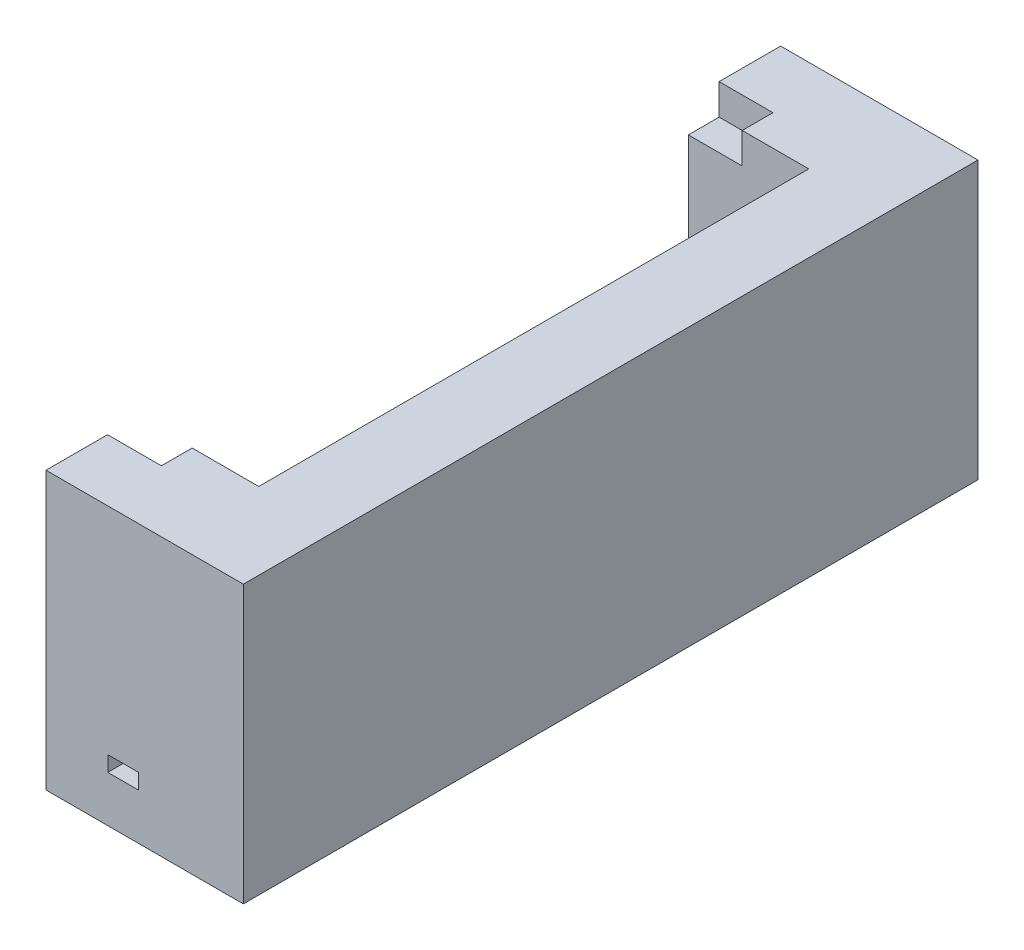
ISO-10303-21;
HEADER;
FILE_DESCRIPTION(('STEP AP214'),'2;1');
FILE_NAME('part.step','',(''),(''),'','','');
FILE_SCHEMA(('AUTOMOTIVE_DESIGN { 1 0 10303 214 1 1 1 1 }'));
ENDSEC;
DATA;
#1=APPLICATION_CONTEXT('core data for automotive mechanical design processes');
#2=APPLICATION_PROTOCOL_DEFINITION('international standard','automotive_design',2000,#1);
#3=PRODUCT_CONTEXT('',#1,'mechanical');
#4=PRODUCT('Part','Part','',(#3));
#5=PRODUCT_RELATED_PRODUCT_CATEGORY('part','',(#4));
#6=PRODUCT_DEFINITION_FORMATION('','',#4);
#7=PRODUCT_DEFINITION_CONTEXT('part definition',#1,'design');
#8=PRODUCT_DEFINITION('design','',#6,#7);
#9=PRODUCT_DEFINITION_SHAPE('','',#8);
#10=(LENGTH_UNIT() NAMED_UNIT(*) SI_UNIT(.MILLI.,.METRE.));
#11=(NAMED_UNIT(*) PLANE_ANGLE_UNIT() SI_UNIT($,.RADIAN.));
#12=(NAMED_UNIT(*) SI_UNIT($,.STERADIAN.) SOLID_ANGLE_UNIT());
#13=UNCERTAINTY_MEASURE_WITH_UNIT(LENGTH_MEASURE(1.E-05),#10,'distance_accuracy_value','');
#14=(GEOMETRIC_REPRESENTATION_CONTEXT(3) GLOBAL_UNCERTAINTY_ASSIGNED_CONTEXT((#13)) GLOBAL_UNIT_ASSIGNED_CONTEXT((#10,
#11,#12)) REPRESENTATION_CONTEXT('',''));
#15=CARTESIAN_POINT('',(0.,0.,0.));
#16=DIRECTION('',(0.,0.,1.));
#17=DIRECTION('',(1.,0.,0.));
#18=AXIS2_PLACEMENT_3D('',#15,#16,#17);
#19=CARTESIAN_POINT('',(0.,0.,71.6587736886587));
#20=DIRECTION('',(0.,0.,-1.));
#21=DIRECTION('',(-1.,0.,0.));
#22=AXIS2_PLACEMENT_3D('',#19,#20,#21);
#23=PLANE('',#22);
#24=DIRECTION('',(0.,1.,0.));
#25=VECTOR('',#24,1.);
#26=CARTESIAN_POINT('',(49.5032063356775,42.3385551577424,71.6587736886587));
#27=LINE('',#26,#25);
#28=CARTESIAN_POINT('',(49.5032063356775,6.33855515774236,71.6587736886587));
#29=VERTEX_POINT('',#28);
#30=CARTESIAN_POINT('',(49.5032063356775,42.3385551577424,71.6587736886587));
#31=VERTEX_POINT('',#30);
#32=EDGE_CURVE('E382',#29,#31,#27,.T.);
#33=ORIENTED_EDGE('',*,*,#32,.T.);
#34=DIRECTION('',(-1.,0.,0.));
#35=VECTOR('',#34,1.);
#36=CARTESIAN_POINT('',(49.5032063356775,42.3385551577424,71.6587736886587));
#37=LINE('',#36,#35);
#38=CARTESIAN_POINT('',(23.8495376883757,42.3385551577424,71.6587736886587));
#39=VERTEX_POINT('',#38);
#40=EDGE_CURVE('E385',#31,#39,#37,.T.);
#41=ORIENTED_EDGE('',*,*,#40,.T.);
#42=DIRECTION('',(0.,-1.,0.));
#43=VECTOR('',#42,1.);
#44=CARTESIAN_POINT('',(23.8495376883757,42.3385551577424,71.6587736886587));
#45=LINE('',#44,#43);
#46=CARTESIAN_POINT('',(23.8495376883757,6.33855515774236,71.6587736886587));
#47=VERTEX_POINT('',#46);
#48=EDGE_CURVE('E388',#39,#47,#45,.T.);
#49=ORIENTED_EDGE('',*,*,#48,.T.);
#50=DIRECTION('',(1.,0.,0.));
#51=VECTOR('',#50,1.);
#52=CARTESIAN_POINT('',(49.5032063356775,6.33855515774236,71.6587736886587));
#53=LINE('',#52,#51);
#54=EDGE_CURVE('E391',#47,#29,#53,.T.);
#55=ORIENTED_EDGE('',*,*,#54,.T.);
#56=EDGE_LOOP('',(#33,#41,#49,#55));
#57=FACE_BOUND('',#56,.T.);
#58=DIRECTION('',(0.,-1.,0.));
#59=VECTOR('',#58,1.);
#60=CARTESIAN_POINT('',(31.8797435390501,12.3385551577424,71.6587736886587));
#61=LINE('',#60,#59);
#62=CARTESIAN_POINT('',(31.8797435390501,14.3385551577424,71.6587736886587));
#63=VERTEX_POINT('',#62);
#64=CARTESIAN_POINT('',(31.8797435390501,12.3385551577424,71.6587736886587));
#65=VERTEX_POINT('',#64);
#66=EDGE_CURVE('E348',#63,#65,#61,.T.);
#67=ORIENTED_EDGE('',*,*,#66,.F.);
#68=DIRECTION('',(-1.,0.,0.));
#69=VECTOR('',#68,1.);
#70=CARTESIAN_POINT('',(31.8797435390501,14.3385551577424,71.6587736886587));
#71=LINE('',#70,#69);
#72=CARTESIAN_POINT('',(35.8797435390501,14.3385551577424,71.6587736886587));
#73=VERTEX_POINT('',#72);
#74=EDGE_CURVE('E356',#73,#63,#71,.T.);
#75=ORIENTED_EDGE('',*,*,#74,.F.);
#76=DIRECTION('',(0.,1.,0.));
#77=VECTOR('',#76,1.);
#78=CARTESIAN_POINT('',(35.8797435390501,12.3385551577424,71.6587736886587));
#79=LINE('',#78,#77);
#80=CARTESIAN_POINT('',(35.8797435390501,12.3385551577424,71.6587736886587));
#81=VERTEX_POINT('',#80);
#82=EDGE_CURVE('E354',#81,#73,#79,.T.);
#83=ORIENTED_EDGE('',*,*,#82,.F.);
#84=DIRECTION('',(1.,0.,0.));
#85=VECTOR('',#84,1.);
#86=CARTESIAN_POINT('',(31.8797435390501,12.3385551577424,71.6587736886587));
#87=LINE('',#86,#85);
#88=EDGE_CURVE('E337',#65,#81,#87,.T.);
#89=ORIENTED_EDGE('',*,*,#88,.F.);
#90=EDGE_LOOP('',(#67,#75,#83,#89));
#91=FACE_BOUND('',#90,.T.);
#92=ADVANCED_FACE('F123',(#57,#91),#23,.F.);
#93=CARTESIAN_POINT('',(0.,0.,-23.8412263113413));
#94=DIRECTION('',(0.,0.,-1.));
#95=DIRECTION('',(-1.,0.,0.));
#96=AXIS2_PLACEMENT_3D('',#93,#94,#95);
#97=PLANE('',#96);
#98=DIRECTION('',(0.,-1.,0.));
#99=VECTOR('',#98,1.);
#100=CARTESIAN_POINT('',(49.5032063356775,42.3385551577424,-23.8412263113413));
#101=LINE('',#100,#99);
#102=CARTESIAN_POINT('',(49.5032063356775,42.3385551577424,-23.8412263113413));
#103=VERTEX_POINT('',#102);
#104=CARTESIAN_POINT('',(49.5032063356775,6.33855515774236,-23.8412263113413));
#105=VERTEX_POINT('',#104);
#106=EDGE_CURVE('E370',#103,#105,#101,.T.);
#107=ORIENTED_EDGE('',*,*,#106,.T.);
#108=DIRECTION('',(-1.,0.,0.));
#109=VECTOR('',#108,1.);
#110=CARTESIAN_POINT('',(49.5032063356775,6.33855515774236,-23.8412263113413));
#111=LINE('',#110,#109);
#112=CARTESIAN_POINT('',(23.8495376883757,6.33855515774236,-23.8412263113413));
#113=VERTEX_POINT('',#112);
#114=EDGE_CURVE('E373',#105,#113,#111,.T.);
#115=ORIENTED_EDGE('',*,*,#114,.T.);
#116=DIRECTION('',(0.,1.,0.));
#117=VECTOR('',#116,1.);
#118=CARTESIAN_POINT('',(23.8495376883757,42.3385551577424,-23.8412263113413));
#119=LINE('',#118,#117);
#120=CARTESIAN_POINT('',(23.8495376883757,42.3385551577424,-23.8412263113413));
#121=VERTEX_POINT('',#120);
#122=EDGE_CURVE('E376',#113,#121,#119,.T.);
#123=ORIENTED_EDGE('',*,*,#122,.T.);
#124=DIRECTION('',(1.,0.,0.));
#125=VECTOR('',#124,1.);
#126=CARTESIAN_POINT('',(49.5032063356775,42.3385551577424,-23.8412263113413));
#127=LINE('',#126,#125);
#128=EDGE_CURVE('E379',#121,#103,#127,.T.);
#129=ORIENTED_EDGE('',*,*,#128,.T.);
#130=EDGE_LOOP('',(#107,#115,#123,#129));
#131=FACE_BOUND('',#130,.T.);
#132=DIRECTION('',(-1.,0.,0.));
#133=VECTOR('',#132,1.);
#134=CARTESIAN_POINT('',(39.494659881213,12.3385551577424,-23.8412263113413));
#135=LINE('',#134,#133);
#136=CARTESIAN_POINT('',(39.494659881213,12.3385551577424,-23.8412263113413));
#137=VERTEX_POINT('',#136);
#138=CARTESIAN_POINT('',(35.494659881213,12.3385551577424,-23.8412263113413));
#139=VERTEX_POINT('',#138);
#140=EDGE_CURVE('E363',#137,#139,#135,.T.);
#141=ORIENTED_EDGE('',*,*,#140,.F.);
#142=DIRECTION('',(0.,-1.,0.));
#143=VECTOR('',#142,1.);
#144=CARTESIAN_POINT('',(39.494659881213,12.3385551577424,-23.8412263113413));
#145=LINE('',#144,#143);
#146=CARTESIAN_POINT('',(39.494659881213,14.2885551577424,-23.8412263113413));
#147=VERTEX_POINT('',#146);
#148=EDGE_CURVE('E360',#147,#137,#145,.T.);
#149=ORIENTED_EDGE('',*,*,#148,.F.);
#150=DIRECTION('',(1.,0.,0.));
#151=VECTOR('',#150,1.);
#152=CARTESIAN_POINT('',(39.494659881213,14.2885551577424,-23.8412263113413));
#153=LINE('',#152,#151);
#154=CARTESIAN_POINT('',(35.494659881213,14.2885551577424,-23.8412263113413));
#155=VERTEX_POINT('',#154);
#156=EDGE_CURVE('E368',#155,#147,#153,.T.);
#157=ORIENTED_EDGE('',*,*,#156,.F.);
#158=DIRECTION('',(0.,1.,0.));
#159=VECTOR('',#158,1.);
#160=CARTESIAN_POINT('',(35.494659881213,12.3385551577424,-23.8412263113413));
#161=LINE('',#160,#159);
#162=EDGE_CURVE('E366',#139,#155,#161,.T.);
#163=ORIENTED_EDGE('',*,*,#162,.F.);
#164=EDGE_LOOP('',(#141,#149,#157,#163));
#165=FACE_BOUND('',#164,.T.);
#166=ADVANCED_FACE('F583',(#131,#165),#97,.T.);
#167=CARTESIAN_POINT('',(0.,19.9385551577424,0.));
#168=DIRECTION('',(0.,1.,0.));
#169=DIRECTION('',(0.,0.,1.));
#170=AXIS2_PLACEMENT_3D('',#167,#168,#169);
#171=PLANE('',#170);
#172=DIRECTION('',(0.,0.,-1.));
#173=VECTOR('',#172,1.);
#174=CARTESIAN_POINT('',(31.8495376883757,19.9385551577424,0.));
#175=LINE('',#174,#173);
#176=CARTESIAN_POINT('',(31.8495376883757,19.9385551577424,59.6587736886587));
#177=VERTEX_POINT('',#176);
#178=CARTESIAN_POINT('',(31.8495376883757,19.9385551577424,30.2042041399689));
#179=VERTEX_POINT('',#178);
#180=EDGE_CURVE('E13',#177,#179,#175,.T.);
#181=ORIENTED_EDGE('',*,*,#180,.F.);
#182=DIRECTION('',(1.,0.,0.));
#183=VECTOR('',#182,1.);
#184=CARTESIAN_POINT('',(23.8495376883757,19.9385551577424,59.6587736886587));
#185=LINE('',#184,#183);
#186=CARTESIAN_POINT('',(39.5032063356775,19.9385551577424,59.6587736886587));
#187=VERTEX_POINT('',#186);
#188=EDGE_CURVE('E438',#177,#187,#185,.T.);
#189=ORIENTED_EDGE('',*,*,#188,.T.);
#190=DIRECTION('',(0.,0.,-1.));
#191=VECTOR('',#190,1.);
#192=CARTESIAN_POINT('',(39.5032063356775,19.9385551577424,-11.8412263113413));
#193=LINE('',#192,#191);
#194=CARTESIAN_POINT('',(39.5032063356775,19.9385551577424,30.2042041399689));
#195=VERTEX_POINT('',#194);
#196=EDGE_CURVE('E441',#187,#195,#193,.T.);
#197=ORIENTED_EDGE('',*,*,#196,.T.);
#198=CARTESIAN_POINT('',(35.6763720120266,19.9385551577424,20.965408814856));
#199=DIRECTION('',(0.,1.,0.));
#200=DIRECTION('',(0.,0.,1.));
#201=AXIS2_PLACEMENT_3D('',#198,#199,#200);
#202=CIRCLE('',#201,10.);
#203=CARTESIAN_POINT('',(39.3921438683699,19.9385551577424,30.2494294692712));
#204=VERTEX_POINT('',#203);
#205=EDGE_CURVE('E452',#195,#204,#202,.F.);
#206=ORIENTED_EDGE('',*,*,#205,.T.);
#207=CARTESIAN_POINT('',(35.6763720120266,19.9385551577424,23.9087736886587));
#208=DIRECTION('',(0.,1.,0.));
#209=DIRECTION('',(0.,0.,-1.));
#210=AXIS2_PLACEMENT_3D('',#207,#208,#209);
#211=ELLIPSE('',#210,26.5112046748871,3.82683432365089);
#212=CARTESIAN_POINT('',(31.9606001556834,19.9385551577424,30.2494294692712));
#213=VERTEX_POINT('',#212);
#214=EDGE_CURVE('E451',#204,#213,#211,.F.);
#215=ORIENTED_EDGE('',*,*,#214,.T.);
#216=EDGE_CURVE('E449',#213,#179,#202,.F.);
#217=ORIENTED_EDGE('',*,*,#216,.T.);
#218=EDGE_LOOP('',(#181,#189,#197,#206,#215,#217));
#219=FACE_BOUND('',#218,.T.);
#220=ADVANCED_FACE('F572',(#219),#171,.T.);
#221=CARTESIAN_POINT('',(31.8495376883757,22.3385551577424,0.));
#222=DIRECTION('',(-1.,0.,0.));
#223=DIRECTION('',(0.,0.,1.));
#224=AXIS2_PLACEMENT_3D('',#221,#222,#223);
#225=PLANE('',#224);
#226=DIRECTION('',(0.,1.,0.));
#227=VECTOR('',#226,1.);
#228=CARTESIAN_POINT('',(31.8495376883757,12.3385551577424,15.1902681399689));
#229=LINE('',#228,#227);
#230=CARTESIAN_POINT('',(31.8495376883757,12.3385551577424,15.1902681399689));
#231=VERTEX_POINT('',#230);
#232=CARTESIAN_POINT('',(31.8495376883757,19.9385551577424,15.1902681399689));
#233=VERTEX_POINT('',#232);
#234=EDGE_CURVE('E758',#231,#233,#229,.T.);
#235=ORIENTED_EDGE('',*,*,#234,.T.);
#236=DIRECTION('',(0.,0.,1.));
#237=VECTOR('',#236,1.);
#238=CARTESIAN_POINT('',(31.8495376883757,19.9385551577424,0.));
#239=LINE('',#238,#237);
#240=CARTESIAN_POINT('',(31.8495376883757,19.9385551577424,-11.8412263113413));
#241=VERTEX_POINT('',#240);
#242=EDGE_CURVE('E417',#241,#233,#239,.T.);
#243=ORIENTED_EDGE('',*,*,#242,.F.);
#244=DIRECTION('',(0.,-1.,0.));
#245=VECTOR('',#244,1.);
#246=CARTESIAN_POINT('',(31.8495376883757,22.9385551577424,-11.8412263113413));
#247=LINE('',#246,#245);
#248=CARTESIAN_POINT('',(31.8495376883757,22.9385551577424,-11.8412263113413));
#249=VERTEX_POINT('',#248);
#250=EDGE_CURVE('E434',#249,#241,#247,.T.);
#251=ORIENTED_EDGE('',*,*,#250,.F.);
#252=DIRECTION('',(0.,0.,1.));
#253=VECTOR('',#252,1.);
#254=CARTESIAN_POINT('',(31.8495376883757,22.9385551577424,0.));
#255=LINE('',#254,#253);
#256=CARTESIAN_POINT('',(31.8495376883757,22.9385551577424,59.6587736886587));
#257=VERTEX_POINT('',#256);
#258=EDGE_CURVE('E418',#249,#257,#255,.T.);
#259=ORIENTED_EDGE('',*,*,#258,.T.);
#260=DIRECTION('',(0.,-1.,0.));
#261=VECTOR('',#260,1.);
#262=CARTESIAN_POINT('',(31.8495376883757,22.9385551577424,59.6587736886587));
#263=LINE('',#262,#261);
#264=EDGE_CURVE('E430',#257,#177,#263,.T.);
#265=ORIENTED_EDGE('',*,*,#264,.T.);
#266=ORIENTED_EDGE('',*,*,#180,.T.);
#267=DIRECTION('',(0.,1.,0.));
#268=VECTOR('',#267,1.);
#269=CARTESIAN_POINT('',(31.8495376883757,12.3385551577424,30.2042041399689));
#270=LINE('',#269,#268);
#271=CARTESIAN_POINT('',(31.8495376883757,12.3385551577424,30.2042041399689));
#272=VERTEX_POINT('',#271);
#273=EDGE_CURVE('E761',#272,#179,#270,.T.);
#274=ORIENTED_EDGE('',*,*,#273,.F.);
#275=DIRECTION('',(0.,0.,1.));
#276=VECTOR('',#275,1.);
#277=CARTESIAN_POINT('',(31.8495376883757,12.3385551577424,0.));
#278=LINE('',#277,#276);
#279=EDGE_CURVE('E772',#231,#272,#278,.T.);
#280=ORIENTED_EDGE('',*,*,#279,.F.);
#281=EDGE_LOOP('',(#235,#243,#251,#259,#265,#266,#274,#280));
#282=FACE_BOUND('',#281,.T.);
#283=ADVANCED_FACE('F506',(#282),#225,.F.);
#284=CARTESIAN_POINT('',(35.6763720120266,12.3385551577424,24.4290634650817));
#285=DIRECTION('',(0.,1.,0.));
#286=DIRECTION('',(0.,0.,1.));
#287=AXIS2_PLACEMENT_3D('',#284,#285,#286);
#288=CYLINDRICAL_SURFACE('',#287,10.);
#289=CARTESIAN_POINT('',(35.6763720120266,19.9385551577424,24.4290634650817));
#290=DIRECTION('',(0.,1.,0.));
#291=DIRECTION('',(0.,0.,1.));
#292=AXIS2_PLACEMENT_3D('',#289,#290,#291);
#293=CIRCLE('',#292,10.);
#294=CARTESIAN_POINT('',(32.0667917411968,19.9385551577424,15.1032428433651));
#295=VERTEX_POINT('',#294);
#296=EDGE_CURVE('E448',#233,#295,#293,.F.);
#297=ORIENTED_EDGE('',*,*,#296,.F.);
#298=ORIENTED_EDGE('',*,*,#234,.F.);
#299=CARTESIAN_POINT('',(35.6763720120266,12.3385551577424,24.4290634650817));
#300=DIRECTION('',(0.,1.,0.));
#301=DIRECTION('',(0.,0.,-1.));
#302=AXIS2_PLACEMENT_3D('',#299,#300,#301);
#303=CIRCLE('',#302,10.);
#304=CARTESIAN_POINT('',(35.494659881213,12.3385551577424,14.4307145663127));
#305=VERTEX_POINT('',#304);
#306=EDGE_CURVE('E777',#305,#231,#303,.T.);
#307=ORIENTED_EDGE('',*,*,#306,.F.);
#308=DIRECTION('',(0.,1.,0.));
#309=VECTOR('',#308,1.);
#310=CARTESIAN_POINT('',(35.494659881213,12.3385551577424,14.4307145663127));
#311=LINE('',#310,#309);
#312=CARTESIAN_POINT('',(35.494659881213,14.2885551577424,14.4307145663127));
#313=VERTEX_POINT('',#312);
#314=EDGE_CURVE('E688',#305,#313,#311,.T.);
#315=ORIENTED_EDGE('',*,*,#314,.T.);
#316=CARTESIAN_POINT('',(35.6763720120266,14.2885551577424,24.4290634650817));
#317=DIRECTION('',(0.,1.,0.));
#318=DIRECTION('',(0.,0.,1.));
#319=AXIS2_PLACEMENT_3D('',#316,#317,#318);
#320=CIRCLE('',#319,10.);
#321=CARTESIAN_POINT('',(39.494659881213,14.2885551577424,15.1867327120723));
#322=VERTEX_POINT('',#321);
#323=EDGE_CURVE('E685',#313,#322,#320,.F.);
#324=ORIENTED_EDGE('',*,*,#323,.T.);
#325=DIRECTION('',(0.,1.,0.));
#326=VECTOR('',#325,1.);
#327=CARTESIAN_POINT('',(39.494659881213,12.3385551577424,15.1867327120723));
#328=LINE('',#327,#326);
#329=CARTESIAN_POINT('',(39.494659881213,12.3385551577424,15.1867327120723));
#330=VERTEX_POINT('',#329);
#331=EDGE_CURVE('E680',#322,#330,#328,.F.);
#332=ORIENTED_EDGE('',*,*,#331,.T.);
#333=CARTESIAN_POINT('',(39.5032063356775,12.3385551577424,15.1902681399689));
#334=VERTEX_POINT('',#333);
#335=EDGE_CURVE('E774',#334,#330,#303,.T.);
#336=ORIENTED_EDGE('',*,*,#335,.F.);
#337=DIRECTION('',(0.,1.,0.));
#338=VECTOR('',#337,1.);
#339=CARTESIAN_POINT('',(39.5032063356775,12.3385551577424,15.1902681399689));
#340=LINE('',#339,#338);
#341=CARTESIAN_POINT('',(39.5032063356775,19.9385551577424,15.1902681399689));
#342=VERTEX_POINT('',#341);
#343=EDGE_CURVE('E749',#334,#342,#340,.T.);
#344=ORIENTED_EDGE('',*,*,#343,.T.);
#345=CARTESIAN_POINT('',(39.2859522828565,19.9385551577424,15.1032428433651));
#346=VERTEX_POINT('',#345);
#347=EDGE_CURVE('E446',#346,#342,#293,.F.);
#348=ORIENTED_EDGE('',*,*,#347,.F.);
#349=DIRECTION('',(0.,1.,0.));
#350=VECTOR('',#349,1.);
#351=CARTESIAN_POINT('',(39.2859522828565,19.5885551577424,15.1032428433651));
#352=LINE('',#351,#350);
#353=CARTESIAN_POINT('',(39.2859522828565,19.5885551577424,15.1032428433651));
#354=VERTEX_POINT('',#353);
#355=EDGE_CURVE('E782',#346,#354,#352,.F.);
#356=ORIENTED_EDGE('',*,*,#355,.T.);
#357=CARTESIAN_POINT('',(35.6763720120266,19.5885551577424,24.4290634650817));
#358=DIRECTION('',(0.,1.,0.));
#359=DIRECTION('',(0.,0.,1.));
#360=AXIS2_PLACEMENT_3D('',#357,#358,#359);
#361=CIRCLE('',#360,10.);
#362=CARTESIAN_POINT('',(32.0667917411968,19.5885551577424,15.1032428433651));
#363=VERTEX_POINT('',#362);
#364=EDGE_CURVE('E488',#363,#354,#361,.F.);
#365=ORIENTED_EDGE('',*,*,#364,.F.);
#366=DIRECTION('',(0.,1.,0.));
#367=VECTOR('',#366,1.);
#368=CARTESIAN_POINT('',(32.0667917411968,19.5885551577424,15.1032428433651));
#369=LINE('',#368,#367);
#370=EDGE_CURVE('E780',#363,#295,#369,.T.);
#371=ORIENTED_EDGE('',*,*,#370,.T.);
#372=EDGE_LOOP('',(#297,#298,#307,#315,#324,#332,#336,#344,#348,#356,#365,#371));
#373=FACE_BOUND('',#372,.T.);
#374=ADVANCED_FACE('F502',(#373),#288,.F.);
#375=CARTESIAN_POINT('',(35.6763720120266,12.3385551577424,20.965408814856));
#376=DIRECTION('',(0.,1.,0.));
#377=DIRECTION('',(0.,0.,1.));
#378=AXIS2_PLACEMENT_3D('',#375,#376,#377);
#379=CYLINDRICAL_SURFACE('',#378,10.);
#380=ORIENTED_EDGE('',*,*,#216,.F.);
#381=DIRECTION('',(0.,1.,0.));
#382=VECTOR('',#381,1.);
#383=CARTESIAN_POINT('',(31.9606001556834,19.5885551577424,30.2494294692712));
#384=LINE('',#383,#382);
#385=CARTESIAN_POINT('',(31.9606001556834,19.5885551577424,30.2494294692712));
#386=VERTEX_POINT('',#385);
#387=EDGE_CURVE('E672',#213,#386,#384,.F.);
#388=ORIENTED_EDGE('',*,*,#387,.T.);
#389=CARTESIAN_POINT('',(35.6763720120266,19.5885551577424,20.965408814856));
#390=DIRECTION('',(0.,1.,0.));
#391=DIRECTION('',(0.,0.,1.));
#392=AXIS2_PLACEMENT_3D('',#389,#390,#391);
#393=CIRCLE('',#392,10.);
#394=CARTESIAN_POINT('',(39.3921438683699,19.5885551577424,30.2494294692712));
#395=VERTEX_POINT('',#394);
#396=EDGE_CURVE('E676',#395,#386,#393,.F.);
#397=ORIENTED_EDGE('',*,*,#396,.F.);
#398=DIRECTION('',(0.,1.,0.));
#399=VECTOR('',#398,1.);
#400=CARTESIAN_POINT('',(39.3921438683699,19.5885551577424,30.2494294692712));
#401=LINE('',#400,#399);
#402=EDGE_CURVE('E664',#395,#204,#401,.T.);
#403=ORIENTED_EDGE('',*,*,#402,.T.);
#404=ORIENTED_EDGE('',*,*,#205,.F.);
#405=DIRECTION('',(0.,1.,0.));
#406=VECTOR('',#405,1.);
#407=CARTESIAN_POINT('',(39.5032063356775,12.3385551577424,30.2042041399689));
#408=LINE('',#407,#406);
#409=CARTESIAN_POINT('',(39.5032063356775,12.3385551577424,30.2042041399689));
#410=VERTEX_POINT('',#409);
#411=EDGE_CURVE('E765',#410,#195,#408,.T.);
#412=ORIENTED_EDGE('',*,*,#411,.F.);
#413=CARTESIAN_POINT('',(35.6763720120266,12.3385551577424,20.965408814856));
#414=DIRECTION('',(0.,1.,0.));
#415=DIRECTION('',(0.,0.,1.));
#416=AXIS2_PLACEMENT_3D('',#413,#414,#415);
#417=CIRCLE('',#416,10.);
#418=CARTESIAN_POINT('',(35.8797435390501,12.3385551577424,30.9633406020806));
#419=VERTEX_POINT('',#418);
#420=EDGE_CURVE('E779',#419,#410,#417,.T.);
#421=ORIENTED_EDGE('',*,*,#420,.F.);
#422=DIRECTION('',(0.,1.,0.));
#423=VECTOR('',#422,1.);
#424=CARTESIAN_POINT('',(35.8797435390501,12.3385551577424,30.9633406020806));
#425=LINE('',#424,#423);
#426=CARTESIAN_POINT('',(35.8797435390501,14.3385551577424,30.9633406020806));
#427=VERTEX_POINT('',#426);
#428=EDGE_CURVE('E696',#419,#427,#425,.T.);
#429=ORIENTED_EDGE('',*,*,#428,.T.);
#430=CARTESIAN_POINT('',(35.6763720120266,14.3385551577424,20.965408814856));
#431=DIRECTION('',(0.,1.,0.));
#432=DIRECTION('',(0.,0.,1.));
#433=AXIS2_PLACEMENT_3D('',#430,#431,#432);
#434=CIRCLE('',#433,10.);
#435=CARTESIAN_POINT('',(31.8797435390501,14.3385551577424,30.2166580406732));
#436=VERTEX_POINT('',#435);
#437=EDGE_CURVE('E693',#427,#436,#434,.F.);
#438=ORIENTED_EDGE('',*,*,#437,.T.);
#439=DIRECTION('',(0.,1.,0.));
#440=VECTOR('',#439,1.);
#441=CARTESIAN_POINT('',(31.8797435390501,12.3385551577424,30.2166580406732));
#442=LINE('',#441,#440);
#443=CARTESIAN_POINT('',(31.8797435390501,12.3385551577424,30.2166580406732));
#444=VERTEX_POINT('',#443);
#445=EDGE_CURVE('E691',#436,#444,#442,.F.);
#446=ORIENTED_EDGE('',*,*,#445,.T.);
#447=EDGE_CURVE('E340',#272,#444,#417,.T.);
#448=ORIENTED_EDGE('',*,*,#447,.F.);
#449=ORIENTED_EDGE('',*,*,#273,.T.);
#450=EDGE_LOOP('',(#380,#388,#397,#403,#404,#412,#421,#429,#438,#446,#448,#449));
#451=FACE_BOUND('',#450,.T.);
#452=ADVANCED_FACE('F496',(#451),#379,.F.);
#453=CARTESIAN_POINT('',(35.6763720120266,19.5885551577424,23.9087736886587));
#454=DIRECTION('',(0.,1.,0.));
#455=DIRECTION('',(0.,0.,-1.));
#456=AXIS2_PLACEMENT_3D('',#453,#454,#455);
#457=ELLIPSE('',#456,26.5112046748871,3.82683432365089);
#458=DIRECTION('',(0.,1.,0.));
#459=VECTOR('',#458,1.);
#460=SURFACE_OF_LINEAR_EXTRUSION('',#457,#459);
#461=ORIENTED_EDGE('',*,*,#214,.F.);
#462=ORIENTED_EDGE('',*,*,#402,.F.);
#463=EDGE_CURVE('E487',#386,#395,#457,.T.);
#464=ORIENTED_EDGE('',*,*,#463,.F.);
#465=ORIENTED_EDGE('',*,*,#387,.F.);
#466=EDGE_LOOP('',(#461,#462,#464,#465));
#467=FACE_BOUND('',#466,.T.);
#468=ADVANCED_FACE('F491',(#467),#460,.F.);
#469=CARTESIAN_POINT('',(35.6763720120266,19.9385551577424,23.9087736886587));
#470=DIRECTION('',(0.,1.,0.));
#471=DIRECTION('',(0.,0.,-1.));
#472=AXIS2_PLACEMENT_3D('',#469,#470,#471);
#473=ELLIPSE('',#472,26.5112046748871,3.82683432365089);
#474=EDGE_CURVE('E131',#295,#346,#473,.F.);
#475=ORIENTED_EDGE('',*,*,#474,.F.);
#476=ORIENTED_EDGE('',*,*,#370,.F.);
#477=EDGE_CURVE('E484',#354,#363,#457,.T.);
#478=ORIENTED_EDGE('',*,*,#477,.F.);
#479=ORIENTED_EDGE('',*,*,#355,.F.);
#480=EDGE_LOOP('',(#475,#476,#478,#479));
#481=FACE_BOUND('',#480,.T.);
#482=ADVANCED_FACE('F495',(#481),#460,.F.);
#483=CARTESIAN_POINT('',(23.8495376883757,22.3385551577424,0.));
#484=DIRECTION('',(-1.,0.,0.));
#485=DIRECTION('',(0.,0.,1.));
#486=AXIS2_PLACEMENT_3D('',#483,#484,#485);
#487=PLANE('',#486);
#488=DIRECTION('',(0.,0.,-1.));
#489=VECTOR('',#488,1.);
#490=CARTESIAN_POINT('',(23.8495376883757,38.3385551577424,63.6587736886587));
#491=LINE('',#490,#489);
#492=CARTESIAN_POINT('',(23.8495376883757,38.3385551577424,63.6587736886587));
#493=VERTEX_POINT('',#492);
#494=CARTESIAN_POINT('',(23.8495376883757,38.3385551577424,59.6587736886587));
#495=VERTEX_POINT('',#494);
#496=EDGE_CURVE('E401',#493,#495,#491,.T.);
#497=ORIENTED_EDGE('',*,*,#496,.T.);
#498=DIRECTION('',(0.,-1.,0.));
#499=VECTOR('',#498,1.);
#500=CARTESIAN_POINT('',(23.8495376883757,42.3385551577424,59.6587736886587));
#501=LINE('',#500,#499);
#502=CARTESIAN_POINT('',(23.8495376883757,22.9385551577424,59.6587736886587));
#503=VERTEX_POINT('',#502);
#504=EDGE_CURVE('E703',#495,#503,#501,.T.);
#505=ORIENTED_EDGE('',*,*,#504,.T.);
#506=DIRECTION('',(0.,0.,1.));
#507=VECTOR('',#506,1.);
#508=CARTESIAN_POINT('',(23.8495376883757,22.9385551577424,0.));
#509=LINE('',#508,#507);
#510=CARTESIAN_POINT('',(23.8495376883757,22.9385551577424,-11.8412263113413));
#511=VERTEX_POINT('',#510);
#512=EDGE_CURVE('E424',#511,#503,#509,.T.);
#513=ORIENTED_EDGE('',*,*,#512,.F.);
#514=DIRECTION('',(0.,-1.,0.));
#515=VECTOR('',#514,1.);
#516=CARTESIAN_POINT('',(23.8495376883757,42.3385551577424,-11.8412263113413));
#517=LINE('',#516,#515);
#518=CARTESIAN_POINT('',(23.8495376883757,38.3385551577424,-11.8412263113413));
#519=VERTEX_POINT('',#518);
#520=EDGE_CURVE('E716',#519,#511,#517,.T.);
#521=ORIENTED_EDGE('',*,*,#520,.F.);
#522=DIRECTION('',(0.,0.,1.));
#523=VECTOR('',#522,1.);
#524=CARTESIAN_POINT('',(23.8495376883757,38.3385551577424,-15.8412263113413));
#525=LINE('',#524,#523);
#526=CARTESIAN_POINT('',(23.8495376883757,38.3385551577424,-15.8412263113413));
#527=VERTEX_POINT('',#526);
#528=EDGE_CURVE('E414',#527,#519,#525,.T.);
#529=ORIENTED_EDGE('',*,*,#528,.F.);
#530=DIRECTION('',(0.,-1.,0.));
#531=VECTOR('',#530,1.);
#532=CARTESIAN_POINT('',(23.8495376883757,38.3385551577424,-15.8412263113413));
#533=LINE('',#532,#531);
#534=CARTESIAN_POINT('',(23.8495376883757,42.3385551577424,-15.8412263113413));
#535=VERTEX_POINT('',#534);
#536=EDGE_CURVE('E409',#535,#527,#533,.T.);
#537=ORIENTED_EDGE('',*,*,#536,.F.);
#538=DIRECTION('',(0.,0.,1.));
#539=VECTOR('',#538,1.);
#540=CARTESIAN_POINT('',(23.8495376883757,42.3385551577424,-19.8412263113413));
#541=LINE('',#540,#539);
#542=EDGE_CURVE('E713',#121,#535,#541,.T.);
#543=ORIENTED_EDGE('',*,*,#542,.F.);
#544=ORIENTED_EDGE('',*,*,#122,.F.);
#545=DIRECTION('',(0.,0.,-1.));
#546=VECTOR('',#545,1.);
#547=CARTESIAN_POINT('',(23.8495376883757,6.33855515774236,67.6587736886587));
#548=LINE('',#547,#546);
#549=EDGE_CURVE('E436',#47,#113,#548,.T.);
#550=ORIENTED_EDGE('',*,*,#549,.F.);
#551=ORIENTED_EDGE('',*,*,#48,.F.);
#552=DIRECTION('',(0.,0.,1.));
#553=VECTOR('',#552,1.);
#554=CARTESIAN_POINT('',(23.8495376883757,42.3385551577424,0.));
#555=LINE('',#554,#553);
#556=CARTESIAN_POINT('',(23.8495376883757,42.3385551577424,63.6587736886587));
#557=VERTEX_POINT('',#556);
#558=EDGE_CURVE('E706',#557,#39,#555,.T.);
#559=ORIENTED_EDGE('',*,*,#558,.F.);
#560=DIRECTION('',(0.,1.,0.));
#561=VECTOR('',#560,1.);
#562=CARTESIAN_POINT('',(23.8495376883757,38.3385551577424,63.6587736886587));
#563=LINE('',#562,#561);
#564=EDGE_CURVE('E398',#493,#557,#563,.T.);
#565=ORIENTED_EDGE('',*,*,#564,.F.);
#566=EDGE_LOOP('',(#497,#505,#513,#521,#529,#537,#543,#544,#550,#551,#559,#565));
#567=FACE_BOUND('',#566,.T.);
#568=ADVANCED_FACE('F574',(#567),#487,.T.);
#569=CARTESIAN_POINT('',(0.,12.3385551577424,0.));
#570=DIRECTION('',(0.,-1.,0.));
#571=DIRECTION('',(0.,0.,-1.));
#572=AXIS2_PLACEMENT_3D('',#569,#570,#571);
#573=PLANE('',#572);
#574=DIRECTION('',(0.,0.,1.));
#575=VECTOR('',#574,1.);
#576=CARTESIAN_POINT('',(31.8797435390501,12.3385551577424,41.1587736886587));
#577=LINE('',#576,#575);
#578=EDGE_CURVE('E334',#444,#65,#577,.T.);
#579=ORIENTED_EDGE('',*,*,#578,.T.);
#580=ORIENTED_EDGE('',*,*,#88,.T.);
#581=DIRECTION('',(0.,0.,1.));
#582=VECTOR('',#581,1.);
#583=CARTESIAN_POINT('',(35.8797435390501,12.3385551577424,41.1587736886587));
#584=LINE('',#583,#582);
#585=EDGE_CURVE('E344',#419,#81,#584,.T.);
#586=ORIENTED_EDGE('',*,*,#585,.F.);
#587=ORIENTED_EDGE('',*,*,#420,.T.);
#588=DIRECTION('',(0.,0.,-1.));
#589=VECTOR('',#588,1.);
#590=CARTESIAN_POINT('',(39.5032063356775,12.3385551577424,0.));
#591=LINE('',#590,#589);
#592=EDGE_CURVE('E762',#410,#334,#591,.T.);
#593=ORIENTED_EDGE('',*,*,#592,.T.);
#594=ORIENTED_EDGE('',*,*,#335,.T.);
#595=DIRECTION('',(0.,0.,-1.));
#596=VECTOR('',#595,1.);
#597=CARTESIAN_POINT('',(39.494659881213,12.3385551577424,-1.84122631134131));
#598=LINE('',#597,#596);
#599=EDGE_CURVE('E722',#330,#137,#598,.T.);
#600=ORIENTED_EDGE('',*,*,#599,.T.);
#601=ORIENTED_EDGE('',*,*,#140,.T.);
#602=DIRECTION('',(0.,0.,-1.));
#603=VECTOR('',#602,1.);
#604=CARTESIAN_POINT('',(35.494659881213,12.3385551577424,-1.84122631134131));
#605=LINE('',#604,#603);
#606=EDGE_CURVE('E724',#305,#139,#605,.T.);
#607=ORIENTED_EDGE('',*,*,#606,.F.);
#608=ORIENTED_EDGE('',*,*,#306,.T.);
#609=ORIENTED_EDGE('',*,*,#279,.T.);
#610=ORIENTED_EDGE('',*,*,#447,.T.);
#611=EDGE_LOOP('',(#579,#580,#586,#587,#593,#594,#600,#601,#607,#608,#609,#610));
#612=FACE_BOUND('',#611,.T.);
#613=ADVANCED_FACE('F125',(#612),#573,.F.);
#614=CARTESIAN_POINT('',(39.494659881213,12.3385551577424,-1.84122631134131));
#615=DIRECTION('',(1.,0.,0.));
#616=DIRECTION('',(0.,0.,-1.));
#617=AXIS2_PLACEMENT_3D('',#614,#615,#616);
#618=PLANE('',#617);
#619=DIRECTION('',(0.,0.,-1.));
#620=VECTOR('',#619,1.);
#621=CARTESIAN_POINT('',(39.494659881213,14.2885551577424,-1.84122631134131));
#622=LINE('',#621,#620);
#623=EDGE_CURVE('E721',#322,#147,#622,.T.);
#624=ORIENTED_EDGE('',*,*,#623,.T.);
#625=ORIENTED_EDGE('',*,*,#148,.T.);
#626=ORIENTED_EDGE('',*,*,#599,.F.);
#627=ORIENTED_EDGE('',*,*,#331,.F.);
#628=EDGE_LOOP('',(#624,#625,#626,#627));
#629=FACE_BOUND('',#628,.T.);
#630=ADVANCED_FACE('F549',(#629),#618,.F.);
#631=CARTESIAN_POINT('',(39.494659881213,14.2885551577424,-1.84122631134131));
#632=DIRECTION('',(0.,1.,0.));
#633=DIRECTION('',(0.,0.,1.));
#634=AXIS2_PLACEMENT_3D('',#631,#632,#633);
#635=PLANE('',#634);
#636=CARTESIAN_POINT('',(37.494659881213,14.2885551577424,5.));
#637=DIRECTION('',(0.,-1.,0.));
#638=DIRECTION('',(0.,0.,-1.));
#639=AXIS2_PLACEMENT_3D('',#636,#637,#638);
#640=CIRCLE('',#639,1.5);
#641=CARTESIAN_POINT('',(37.494659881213,14.2885551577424,3.5));
#642=VERTEX_POINT('',#641);
#643=EDGE_CURVE('E458',#642,#642,#640,.T.);
#644=ORIENTED_EDGE('',*,*,#643,.F.);
#645=EDGE_LOOP('',(#644));
#646=FACE_BOUND('',#645,.T.);
#647=CARTESIAN_POINT('',(37.494659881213,14.2885551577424,8.5));
#648=DIRECTION('',(0.,-1.,0.));
#649=DIRECTION('',(0.,0.,-1.));
#650=AXIS2_PLACEMENT_3D('',#647,#648,#649);
#651=CIRCLE('',#650,1.5);
#652=CARTESIAN_POINT('',(37.494659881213,14.2885551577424,7.));
#653=VERTEX_POINT('',#652);
#654=EDGE_CURVE('E468',#653,#653,#651,.T.);
#655=ORIENTED_EDGE('',*,*,#654,.F.);
#656=EDGE_LOOP('',(#655));
#657=FACE_BOUND('',#656,.T.);
#658=CARTESIAN_POINT('',(37.494659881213,14.2885551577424,12.));
#659=DIRECTION('',(0.,-1.,0.));
#660=DIRECTION('',(0.,0.,-1.));
#661=AXIS2_PLACEMENT_3D('',#658,#659,#660);
#662=CIRCLE('',#661,1.5);
#663=CARTESIAN_POINT('',(37.494659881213,14.2885551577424,10.5));
#664=VERTEX_POINT('',#663);
#665=EDGE_CURVE('E478',#664,#664,#662,.T.);
#666=ORIENTED_EDGE('',*,*,#665,.F.);
#667=EDGE_LOOP('',(#666));
#668=FACE_BOUND('',#667,.T.);
#669=DIRECTION('',(0.,0.,-1.));
#670=VECTOR('',#669,1.);
#671=CARTESIAN_POINT('',(35.494659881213,14.2885551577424,-1.84122631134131));
#672=LINE('',#671,#670);
#673=EDGE_CURVE('E146',#313,#155,#672,.T.);
#674=ORIENTED_EDGE('',*,*,#673,.T.);
#675=ORIENTED_EDGE('',*,*,#156,.T.);
#676=ORIENTED_EDGE('',*,*,#623,.F.);
#677=ORIENTED_EDGE('',*,*,#323,.F.);
#678=EDGE_LOOP('',(#674,#675,#676,#677));
#679=FACE_BOUND('',#678,.T.);
#680=ADVANCED_FACE('F546',(#646,#657,#668,#679),#635,.F.);
#681=CARTESIAN_POINT('',(35.494659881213,12.3385551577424,-1.84122631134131));
#682=DIRECTION('',(-1.,0.,0.));
#683=DIRECTION('',(0.,0.,1.));
#684=AXIS2_PLACEMENT_3D('',#681,#682,#683);
#685=PLANE('',#684);
#686=ORIENTED_EDGE('',*,*,#606,.T.);
#687=ORIENTED_EDGE('',*,*,#162,.T.);
#688=ORIENTED_EDGE('',*,*,#673,.F.);
#689=ORIENTED_EDGE('',*,*,#314,.F.);
#690=EDGE_LOOP('',(#686,#687,#688,#689));
#691=FACE_BOUND('',#690,.T.);
#692=ADVANCED_FACE('F545',(#691),#685,.F.);
#693=CARTESIAN_POINT('',(31.8797435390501,12.3385551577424,41.1587736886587));
#694=DIRECTION('',(-1.,0.,0.));
#695=DIRECTION('',(0.,0.,1.));
#696=AXIS2_PLACEMENT_3D('',#693,#694,#695);
#697=PLANE('',#696);
#698=DIRECTION('',(0.,0.,1.));
#699=VECTOR('',#698,1.);
#700=CARTESIAN_POINT('',(31.8797435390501,14.3385551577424,41.1587736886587));
#701=LINE('',#700,#699);
#702=EDGE_CURVE('E350',#436,#63,#701,.T.);
#703=ORIENTED_EDGE('',*,*,#702,.T.);
#704=ORIENTED_EDGE('',*,*,#66,.T.);
#705=ORIENTED_EDGE('',*,*,#578,.F.);
#706=ORIENTED_EDGE('',*,*,#445,.F.);
#707=EDGE_LOOP('',(#703,#704,#705,#706));
#708=FACE_BOUND('',#707,.T.);
#709=ADVANCED_FACE('F349',(#708),#697,.F.);
#710=CARTESIAN_POINT('',(31.8797435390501,14.3385551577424,41.1587736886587));
#711=DIRECTION('',(0.,1.,0.));
#712=DIRECTION('',(0.,0.,1.));
#713=AXIS2_PLACEMENT_3D('',#710,#711,#712);
#714=PLANE('',#713);
#715=CARTESIAN_POINT('',(33.9,14.3385551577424,40.));
#716=DIRECTION('',(0.,1.,0.));
#717=DIRECTION('',(0.,0.,1.));
#718=AXIS2_PLACEMENT_3D('',#715,#716,#717);
#719=CIRCLE('',#718,1.5);
#720=CARTESIAN_POINT('',(33.9,14.3385551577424,41.5));
#721=VERTEX_POINT('',#720);
#722=EDGE_CURVE('E457',#721,#721,#719,.T.);
#723=ORIENTED_EDGE('',*,*,#722,.T.);
#724=EDGE_LOOP('',(#723));
#725=FACE_BOUND('',#724,.T.);
#726=CARTESIAN_POINT('',(33.9,14.3385551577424,36.5));
#727=DIRECTION('',(0.,1.,0.));
#728=DIRECTION('',(0.,0.,1.));
#729=AXIS2_PLACEMENT_3D('',#726,#727,#728);
#730=CIRCLE('',#729,1.5);
#731=CARTESIAN_POINT('',(33.9,14.3385551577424,38.));
#732=VERTEX_POINT('',#731);
#733=EDGE_CURVE('E467',#732,#732,#730,.T.);
#734=ORIENTED_EDGE('',*,*,#733,.T.);
#735=EDGE_LOOP('',(#734));
#736=FACE_BOUND('',#735,.T.);
#737=CARTESIAN_POINT('',(33.9,14.3385551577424,33.));
#738=DIRECTION('',(0.,1.,0.));
#739=DIRECTION('',(0.,0.,1.));
#740=AXIS2_PLACEMENT_3D('',#737,#738,#739);
#741=CIRCLE('',#740,1.5);
#742=CARTESIAN_POINT('',(33.9,14.3385551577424,34.5));
#743=VERTEX_POINT('',#742);
#744=EDGE_CURVE('E477',#743,#743,#741,.T.);
#745=ORIENTED_EDGE('',*,*,#744,.T.);
#746=EDGE_LOOP('',(#745));
#747=FACE_BOUND('',#746,.T.);
#748=DIRECTION('',(0.,0.,1.));
#749=VECTOR('',#748,1.);
#750=CARTESIAN_POINT('',(35.8797435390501,14.3385551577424,41.1587736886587));
#751=LINE('',#750,#749);
#752=EDGE_CURVE('E138',#427,#73,#751,.T.);
#753=ORIENTED_EDGE('',*,*,#752,.T.);
#754=ORIENTED_EDGE('',*,*,#74,.T.);
#755=ORIENTED_EDGE('',*,*,#702,.F.);
#756=ORIENTED_EDGE('',*,*,#437,.F.);
#757=EDGE_LOOP('',(#753,#754,#755,#756));
#758=FACE_BOUND('',#757,.T.);
#759=ADVANCED_FACE('F534',(#725,#736,#747,#758),#714,.F.);
#760=CARTESIAN_POINT('',(35.8797435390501,12.3385551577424,41.1587736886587));
#761=DIRECTION('',(1.,0.,0.));
#762=DIRECTION('',(0.,0.,-1.));
#763=AXIS2_PLACEMENT_3D('',#760,#761,#762);
#764=PLANE('',#763);
#765=ORIENTED_EDGE('',*,*,#585,.T.);
#766=ORIENTED_EDGE('',*,*,#82,.T.);
#767=ORIENTED_EDGE('',*,*,#752,.F.);
#768=ORIENTED_EDGE('',*,*,#428,.F.);
#769=EDGE_LOOP('',(#765,#766,#767,#768));
#770=FACE_BOUND('',#769,.T.);
#771=ADVANCED_FACE('F537',(#770),#764,.F.);
#772=CARTESIAN_POINT('',(39.5032063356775,22.3385551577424,0.));
#773=DIRECTION('',(-1.,0.,0.));
#774=DIRECTION('',(0.,0.,1.));
#775=AXIS2_PLACEMENT_3D('',#772,#773,#774);
#776=PLANE('',#775);
#777=ORIENTED_EDGE('',*,*,#196,.F.);
#778=DIRECTION('',(0.,-1.,0.));
#779=VECTOR('',#778,1.);
#780=CARTESIAN_POINT('',(39.5032063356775,22.3385551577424,59.6587736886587));
#781=LINE('',#780,#779);
#782=CARTESIAN_POINT('',(39.5032063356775,42.3385551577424,59.6587736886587));
#783=VERTEX_POINT('',#782);
#784=EDGE_CURVE('E700',#783,#187,#781,.T.);
#785=ORIENTED_EDGE('',*,*,#784,.F.);
#786=DIRECTION('',(0.,0.,1.));
#787=VECTOR('',#786,1.);
#788=CARTESIAN_POINT('',(39.5032063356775,42.3385551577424,-11.8412263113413));
#789=LINE('',#788,#787);
#790=CARTESIAN_POINT('',(39.5032063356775,42.3385551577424,-11.8412263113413));
#791=VERTEX_POINT('',#790);
#792=EDGE_CURVE('E718',#791,#783,#789,.T.);
#793=ORIENTED_EDGE('',*,*,#792,.F.);
#794=DIRECTION('',(0.,-1.,0.));
#795=VECTOR('',#794,1.);
#796=CARTESIAN_POINT('',(39.5032063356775,22.3385551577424,-11.8412263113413));
#797=LINE('',#796,#795);
#798=CARTESIAN_POINT('',(39.5032063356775,19.9385551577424,-11.8412263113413));
#799=VERTEX_POINT('',#798);
#800=EDGE_CURVE('E699',#791,#799,#797,.T.);
#801=ORIENTED_EDGE('',*,*,#800,.T.);
#802=EDGE_CURVE('E440',#342,#799,#193,.T.);
#803=ORIENTED_EDGE('',*,*,#802,.F.);
#804=ORIENTED_EDGE('',*,*,#343,.F.);
#805=ORIENTED_EDGE('',*,*,#592,.F.);
#806=ORIENTED_EDGE('',*,*,#411,.T.);
#807=EDGE_LOOP('',(#777,#785,#793,#801,#803,#804,#805,#806));
#808=FACE_BOUND('',#807,.T.);
#809=ADVANCED_FACE('F541',(#808),#776,.T.);
#810=CARTESIAN_POINT('',(0.,22.3385551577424,59.6587736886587));
#811=DIRECTION('',(0.,0.,-1.));
#812=DIRECTION('',(-1.,0.,0.));
#813=AXIS2_PLACEMENT_3D('',#810,#811,#812);
#814=PLANE('',#813);
#815=ORIENTED_EDGE('',*,*,#504,.F.);
#816=DIRECTION('',(-1.,0.,0.));
#817=VECTOR('',#816,1.);
#818=CARTESIAN_POINT('',(26.8495376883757,38.3385551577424,59.6587736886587));
#819=LINE('',#818,#817);
#820=CARTESIAN_POINT('',(30.8495376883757,38.3385551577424,59.6587736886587));
#821=VERTEX_POINT('',#820);
#822=EDGE_CURVE('E738',#821,#495,#819,.T.);
#823=ORIENTED_EDGE('',*,*,#822,.F.);
#824=DIRECTION('',(0.,1.,0.));
#825=VECTOR('',#824,1.);
#826=CARTESIAN_POINT('',(30.8495376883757,38.3385551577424,59.6587736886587));
#827=LINE('',#826,#825);
#828=CARTESIAN_POINT('',(30.8495376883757,42.3385551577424,59.6587736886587));
#829=VERTEX_POINT('',#828);
#830=EDGE_CURVE('E746',#821,#829,#827,.T.);
#831=ORIENTED_EDGE('',*,*,#830,.T.);
#832=DIRECTION('',(-1.,0.,0.));
#833=VECTOR('',#832,1.);
#834=CARTESIAN_POINT('',(0.,42.3385551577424,59.6587736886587));
#835=LINE('',#834,#833);
#836=EDGE_CURVE('E708',#783,#829,#835,.T.);
#837=ORIENTED_EDGE('',*,*,#836,.F.);
#838=ORIENTED_EDGE('',*,*,#784,.T.);
#839=ORIENTED_EDGE('',*,*,#188,.F.);
#840=ORIENTED_EDGE('',*,*,#264,.F.);
#841=DIRECTION('',(1.,0.,0.));
#842=VECTOR('',#841,1.);
#843=CARTESIAN_POINT('',(0.,22.9385551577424,59.6587736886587));
#844=LINE('',#843,#842);
#845=EDGE_CURVE('E427',#503,#257,#844,.T.);
#846=ORIENTED_EDGE('',*,*,#845,.F.);
#847=EDGE_LOOP('',(#815,#823,#831,#837,#838,#839,#840,#846));
#848=FACE_BOUND('',#847,.T.);
#849=ADVANCED_FACE('F563',(#848),#814,.T.);
#850=CARTESIAN_POINT('',(0.,22.3385551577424,-11.8412263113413));
#851=DIRECTION('',(0.,0.,-1.));
#852=DIRECTION('',(-1.,0.,0.));
#853=AXIS2_PLACEMENT_3D('',#850,#851,#852);
#854=PLANE('',#853);
#855=DIRECTION('',(1.,0.,0.));
#856=VECTOR('',#855,1.);
#857=CARTESIAN_POINT('',(26.8495376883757,38.3385551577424,-11.8412263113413));
#858=LINE('',#857,#856);
#859=CARTESIAN_POINT('',(30.8495376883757,38.3385551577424,-11.8412263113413));
#860=VERTEX_POINT('',#859);
#861=EDGE_CURVE('E754',#519,#860,#858,.T.);
#862=ORIENTED_EDGE('',*,*,#861,.F.);
#863=ORIENTED_EDGE('',*,*,#520,.T.);
#864=DIRECTION('',(-1.,0.,0.));
#865=VECTOR('',#864,1.);
#866=CARTESIAN_POINT('',(0.,22.9385551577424,-11.8412263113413));
#867=LINE('',#866,#865);
#868=EDGE_CURVE('E421',#249,#511,#867,.T.);
#869=ORIENTED_EDGE('',*,*,#868,.F.);
#870=ORIENTED_EDGE('',*,*,#250,.T.);
#871=DIRECTION('',(-1.,0.,0.));
#872=VECTOR('',#871,1.);
#873=CARTESIAN_POINT('',(23.8495376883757,19.9385551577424,-11.8412263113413));
#874=LINE('',#873,#872);
#875=EDGE_CURVE('E443',#799,#241,#874,.T.);
#876=ORIENTED_EDGE('',*,*,#875,.F.);
#877=ORIENTED_EDGE('',*,*,#800,.F.);
#878=DIRECTION('',(1.,0.,0.));
#879=VECTOR('',#878,1.);
#880=CARTESIAN_POINT('',(23.8495376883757,42.3385551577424,-11.8412263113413));
#881=LINE('',#880,#879);
#882=CARTESIAN_POINT('',(30.8495376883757,42.3385551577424,-11.8412263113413));
#883=VERTEX_POINT('',#882);
#884=EDGE_CURVE('E711',#883,#791,#881,.T.);
#885=ORIENTED_EDGE('',*,*,#884,.F.);
#886=DIRECTION('',(0.,1.,0.));
#887=VECTOR('',#886,1.);
#888=CARTESIAN_POINT('',(30.8495376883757,38.3385551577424,-11.8412263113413));
#889=LINE('',#888,#887);
#890=EDGE_CURVE('E345',#860,#883,#889,.T.);
#891=ORIENTED_EDGE('',*,*,#890,.F.);
#892=EDGE_LOOP('',(#862,#863,#869,#870,#876,#877,#885,#891));
#893=FACE_BOUND('',#892,.T.);
#894=ADVANCED_FACE('F559',(#893),#854,.F.);
#895=CARTESIAN_POINT('',(0.,42.3385551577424,0.));
#896=DIRECTION('',(0.,1.,0.));
#897=DIRECTION('',(0.,0.,1.));
#898=AXIS2_PLACEMENT_3D('',#895,#896,#897);
#899=PLANE('',#898);
#900=DIRECTION('',(1.,0.,0.));
#901=VECTOR('',#900,1.);
#902=CARTESIAN_POINT('',(26.8495376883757,42.3385551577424,63.6587736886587));
#903=LINE('',#902,#901);
#904=CARTESIAN_POINT('',(30.8495376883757,42.3385551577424,63.6587736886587));
#905=VERTEX_POINT('',#904);
#906=EDGE_CURVE('E741',#557,#905,#903,.T.);
#907=ORIENTED_EDGE('',*,*,#906,.F.);
#908=ORIENTED_EDGE('',*,*,#558,.T.);
#909=ORIENTED_EDGE('',*,*,#40,.F.);
#910=DIRECTION('',(0.,0.,1.));
#911=VECTOR('',#910,1.);
#912=CARTESIAN_POINT('',(49.5032063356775,42.3385551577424,-21.8412263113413));
#913=LINE('',#912,#911);
#914=EDGE_CURVE('E394',#103,#31,#913,.T.);
#915=ORIENTED_EDGE('',*,*,#914,.F.);
#916=ORIENTED_EDGE('',*,*,#128,.F.);
#917=ORIENTED_EDGE('',*,*,#542,.T.);
#918=DIRECTION('',(-1.,0.,0.));
#919=VECTOR('',#918,1.);
#920=CARTESIAN_POINT('',(30.8495376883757,42.3385551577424,-15.8412263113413));
#921=LINE('',#920,#919);
#922=CARTESIAN_POINT('',(30.8495376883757,42.3385551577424,-15.8412263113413));
#923=VERTEX_POINT('',#922);
#924=EDGE_CURVE('E407',#923,#535,#921,.T.);
#925=ORIENTED_EDGE('',*,*,#924,.F.);
#926=DIRECTION('',(0.,0.,-1.));
#927=VECTOR('',#926,1.);
#928=CARTESIAN_POINT('',(30.8495376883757,42.3385551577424,-11.8412263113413));
#929=LINE('',#928,#927);
#930=EDGE_CURVE('E744',#883,#923,#929,.T.);
#931=ORIENTED_EDGE('',*,*,#930,.F.);
#932=ORIENTED_EDGE('',*,*,#884,.T.);
#933=ORIENTED_EDGE('',*,*,#792,.T.);
#934=ORIENTED_EDGE('',*,*,#836,.T.);
#935=DIRECTION('',(0.,0.,-1.));
#936=VECTOR('',#935,1.);
#937=CARTESIAN_POINT('',(30.8495376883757,42.3385551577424,59.6587736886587));
#938=LINE('',#937,#936);
#939=EDGE_CURVE('E734',#905,#829,#938,.T.);
#940=ORIENTED_EDGE('',*,*,#939,.F.);
#941=EDGE_LOOP('',(#907,#908,#909,#915,#916,#917,#925,#931,#932,#933,#934,#940));
#942=FACE_BOUND('',#941,.T.);
#943=ADVANCED_FACE('F532',(#942),#899,.T.);
#944=CARTESIAN_POINT('',(0.,6.33855515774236,0.));
#945=DIRECTION('',(0.,1.,0.));
#946=DIRECTION('',(0.,0.,1.));
#947=AXIS2_PLACEMENT_3D('',#944,#945,#946);
#948=PLANE('',#947);
#949=ORIENTED_EDGE('',*,*,#549,.T.);
#950=ORIENTED_EDGE('',*,*,#114,.F.);
#951=DIRECTION('',(0.,0.,-1.));
#952=VECTOR('',#951,1.);
#953=CARTESIAN_POINT('',(49.5032063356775,6.33855515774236,-21.8412263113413));
#954=LINE('',#953,#952);
#955=EDGE_CURVE('E396',#29,#105,#954,.T.);
#956=ORIENTED_EDGE('',*,*,#955,.F.);
#957=ORIENTED_EDGE('',*,*,#54,.F.);
#958=EDGE_LOOP('',(#949,#950,#956,#957));
#959=FACE_BOUND('',#958,.T.);
#960=ADVANCED_FACE('F525',(#959),#948,.F.);
#961=CARTESIAN_POINT('',(30.8495376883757,38.3385551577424,59.6587736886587));
#962=DIRECTION('',(1.,0.,0.));
#963=DIRECTION('',(0.,0.,-1.));
#964=AXIS2_PLACEMENT_3D('',#961,#962,#963);
#965=PLANE('',#964);
#966=ORIENTED_EDGE('',*,*,#939,.T.);
#967=ORIENTED_EDGE('',*,*,#830,.F.);
#968=DIRECTION('',(0.,0.,-1.));
#969=VECTOR('',#968,1.);
#970=CARTESIAN_POINT('',(30.8495376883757,38.3385551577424,59.6587736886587));
#971=LINE('',#970,#969);
#972=CARTESIAN_POINT('',(30.8495376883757,38.3385551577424,63.6587736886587));
#973=VERTEX_POINT('',#972);
#974=EDGE_CURVE('E735',#973,#821,#971,.T.);
#975=ORIENTED_EDGE('',*,*,#974,.F.);
#976=DIRECTION('',(0.,1.,0.));
#977=VECTOR('',#976,1.);
#978=CARTESIAN_POINT('',(30.8495376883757,38.3385551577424,63.6587736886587));
#979=LINE('',#978,#977);
#980=EDGE_CURVE('E740',#973,#905,#979,.T.);
#981=ORIENTED_EDGE('',*,*,#980,.T.);
#982=EDGE_LOOP('',(#966,#967,#975,#981));
#983=FACE_BOUND('',#982,.T.);
#984=ADVANCED_FACE('F521',(#983),#965,.F.);
#985=CARTESIAN_POINT('',(26.8495376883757,38.3385551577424,63.6587736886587));
#986=DIRECTION('',(0.,0.,1.));
#987=DIRECTION('',(1.,0.,0.));
#988=AXIS2_PLACEMENT_3D('',#985,#986,#987);
#989=PLANE('',#988);
#990=ORIENTED_EDGE('',*,*,#906,.T.);
#991=ORIENTED_EDGE('',*,*,#980,.F.);
#992=DIRECTION('',(1.,0.,0.));
#993=VECTOR('',#992,1.);
#994=CARTESIAN_POINT('',(26.8495376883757,38.3385551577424,63.6587736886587));
#995=LINE('',#994,#993);
#996=EDGE_CURVE('E731',#493,#973,#995,.T.);
#997=ORIENTED_EDGE('',*,*,#996,.F.);
#998=ORIENTED_EDGE('',*,*,#564,.T.);
#999=EDGE_LOOP('',(#990,#991,#997,#998));
#1000=FACE_BOUND('',#999,.T.);
#1001=ADVANCED_FACE('F518',(#1000),#989,.F.);
#1002=CARTESIAN_POINT('',(0.,38.3385551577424,0.));
#1003=DIRECTION('',(0.,1.,0.));
#1004=DIRECTION('',(0.,0.,1.));
#1005=AXIS2_PLACEMENT_3D('',#1002,#1003,#1004);
#1006=PLANE('',#1005);
#1007=ORIENTED_EDGE('',*,*,#822,.T.);
#1008=ORIENTED_EDGE('',*,*,#496,.F.);
#1009=ORIENTED_EDGE('',*,*,#996,.T.);
#1010=ORIENTED_EDGE('',*,*,#974,.T.);
#1011=EDGE_LOOP('',(#1007,#1008,#1009,#1010));
#1012=FACE_BOUND('',#1011,.T.);
#1013=ADVANCED_FACE('F516',(#1012),#1006,.T.);
#1014=CARTESIAN_POINT('',(30.8495376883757,38.3385551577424,-11.8412263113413));
#1015=DIRECTION('',(1.,0.,0.));
#1016=DIRECTION('',(0.,0.,-1.));
#1017=AXIS2_PLACEMENT_3D('',#1014,#1015,#1016);
#1018=PLANE('',#1017);
#1019=ORIENTED_EDGE('',*,*,#930,.T.);
#1020=DIRECTION('',(0.,1.,0.));
#1021=VECTOR('',#1020,1.);
#1022=CARTESIAN_POINT('',(30.8495376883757,38.3385551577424,-15.8412263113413));
#1023=LINE('',#1022,#1021);
#1024=CARTESIAN_POINT('',(30.8495376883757,38.3385551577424,-15.8412263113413));
#1025=VERTEX_POINT('',#1024);
#1026=EDGE_CURVE('E404',#1025,#923,#1023,.T.);
#1027=ORIENTED_EDGE('',*,*,#1026,.F.);
#1028=DIRECTION('',(0.,0.,-1.));
#1029=VECTOR('',#1028,1.);
#1030=CARTESIAN_POINT('',(30.8495376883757,38.3385551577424,-11.8412263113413));
#1031=LINE('',#1030,#1029);
#1032=EDGE_CURVE('E752',#860,#1025,#1031,.T.);
#1033=ORIENTED_EDGE('',*,*,#1032,.F.);
#1034=ORIENTED_EDGE('',*,*,#890,.T.);
#1035=EDGE_LOOP('',(#1019,#1027,#1033,#1034));
#1036=FACE_BOUND('',#1035,.T.);
#1037=ADVANCED_FACE('F512',(#1036),#1018,.F.);
#1038=CARTESIAN_POINT('',(0.,38.3385551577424,0.));
#1039=DIRECTION('',(0.,-1.,0.));
#1040=DIRECTION('',(0.,0.,-1.));
#1041=AXIS2_PLACEMENT_3D('',#1038,#1039,#1040);
#1042=PLANE('',#1041);
#1043=ORIENTED_EDGE('',*,*,#528,.T.);
#1044=ORIENTED_EDGE('',*,*,#861,.T.);
#1045=ORIENTED_EDGE('',*,*,#1032,.T.);
#1046=DIRECTION('',(1.,0.,0.));
#1047=VECTOR('',#1046,1.);
#1048=CARTESIAN_POINT('',(30.8495376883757,38.3385551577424,-15.8412263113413));
#1049=LINE('',#1048,#1047);
#1050=EDGE_CURVE('E411',#527,#1025,#1049,.T.);
#1051=ORIENTED_EDGE('',*,*,#1050,.F.);
#1052=EDGE_LOOP('',(#1043,#1044,#1045,#1051));
#1053=FACE_BOUND('',#1052,.T.);
#1054=ADVANCED_FACE('F508',(#1053),#1042,.F.);
#1055=CARTESIAN_POINT('',(0.,19.5885551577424,0.));
#1056=DIRECTION('',(0.,1.,0.));
#1057=DIRECTION('',(0.,0.,1.));
#1058=AXIS2_PLACEMENT_3D('',#1055,#1056,#1057);
#1059=PLANE('',#1058);
#1060=ORIENTED_EDGE('',*,*,#396,.T.);
#1061=ORIENTED_EDGE('',*,*,#463,.T.);
#1062=EDGE_LOOP('',(#1060,#1061));
#1063=FACE_BOUND('',#1062,.T.);
#1064=ADVANCED_FACE('F511',(#1063),#1059,.T.);
#1065=ORIENTED_EDGE('',*,*,#364,.T.);
#1066=ORIENTED_EDGE('',*,*,#477,.T.);
#1067=EDGE_LOOP('',(#1065,#1066));
#1068=FACE_BOUND('',#1067,.T.);
#1069=ADVANCED_FACE('F498',(#1068),#1059,.T.);
#1070=CARTESIAN_POINT('',(33.9,19.0885551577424,33.));
#1071=DIRECTION('',(0.,-1.,0.));
#1072=DIRECTION('',(0.,0.,-1.));
#1073=AXIS2_PLACEMENT_3D('',#1070,#1071,#1072);
#1074=CYLINDRICAL_SURFACE('',#1073,1.5);
#1075=CARTESIAN_POINT('',(33.9,19.0885551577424,33.));
#1076=DIRECTION('',(0.,-1.,0.));
#1077=DIRECTION('',(0.,0.,-1.));
#1078=AXIS2_PLACEMENT_3D('',#1075,#1076,#1077);
#1079=CIRCLE('',#1078,1.5);
#1080=CARTESIAN_POINT('',(33.9,19.0885551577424,31.5));
#1081=VERTEX_POINT('',#1080);
#1082=EDGE_CURVE('E481',#1081,#1081,#1079,.T.);
#1083=ORIENTED_EDGE('',*,*,#1082,.F.);
#1084=EDGE_LOOP('',(#1083));
#1085=FACE_BOUND('',#1084,.T.);
#1086=ORIENTED_EDGE('',*,*,#744,.F.);
#1087=EDGE_LOOP('',(#1086));
#1088=FACE_BOUND('',#1087,.T.);
#1089=ADVANCED_FACE('F649',(#1085,#1088),#1074,.F.);
#1090=CARTESIAN_POINT('',(33.9,19.0885551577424,33.));
#1091=DIRECTION('',(0.,-1.,0.));
#1092=DIRECTION('',(0.,0.,-1.));
#1093=AXIS2_PLACEMENT_3D('',#1090,#1091,#1092);
#1094=PLANE('',#1093);
#1095=ORIENTED_EDGE('',*,*,#1082,.T.);
#1096=EDGE_LOOP('',(#1095));
#1097=FACE_BOUND('',#1096,.T.);
#1098=ADVANCED_FACE('F647',(#1097),#1094,.T.);
#1099=CARTESIAN_POINT('',(37.494659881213,19.0885551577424,12.));
#1100=DIRECTION('',(0.,-1.,0.));
#1101=DIRECTION('',(0.,0.,-1.));
#1102=AXIS2_PLACEMENT_3D('',#1099,#1100,#1101);
#1103=CYLINDRICAL_SURFACE('',#1102,1.5);
#1104=CARTESIAN_POINT('',(37.494659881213,19.0885551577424,12.));
#1105=DIRECTION('',(0.,-1.,0.));
#1106=DIRECTION('',(0.,0.,-1.));
#1107=AXIS2_PLACEMENT_3D('',#1104,#1105,#1106);
#1108=CIRCLE('',#1107,1.5);
#1109=CARTESIAN_POINT('',(37.494659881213,19.0885551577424,10.5));
#1110=VERTEX_POINT('',#1109);
#1111=EDGE_CURVE('E474',#1110,#1110,#1108,.T.);
#1112=ORIENTED_EDGE('',*,*,#1111,.F.);
#1113=EDGE_LOOP('',(#1112));
#1114=FACE_BOUND('',#1113,.T.);
#1115=ORIENTED_EDGE('',*,*,#665,.T.);
#1116=EDGE_LOOP('',(#1115));
#1117=FACE_BOUND('',#1116,.T.);
#1118=ADVANCED_FACE('F643',(#1114,#1117),#1103,.F.);
#1119=CARTESIAN_POINT('',(0.,19.0885551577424,0.));
#1120=DIRECTION('',(0.,-1.,0.));
#1121=DIRECTION('',(0.,0.,-1.));
#1122=AXIS2_PLACEMENT_3D('',#1119,#1120,#1121);
#1123=PLANE('',#1122);
#1124=ORIENTED_EDGE('',*,*,#1111,.T.);
#1125=EDGE_LOOP('',(#1124));
#1126=FACE_BOUND('',#1125,.T.);
#1127=ADVANCED_FACE('F636',(#1126),#1123,.T.);
#1128=CARTESIAN_POINT('',(33.9,17.4885551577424,36.5));
#1129=DIRECTION('',(0.,-1.,0.));
#1130=DIRECTION('',(0.,0.,-1.));
#1131=AXIS2_PLACEMENT_3D('',#1128,#1129,#1130);
#1132=CYLINDRICAL_SURFACE('',#1131,1.5);
#1133=CARTESIAN_POINT('',(33.9,17.4885551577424,36.5));
#1134=DIRECTION('',(0.,-1.,0.));
#1135=DIRECTION('',(0.,0.,-1.));
#1136=AXIS2_PLACEMENT_3D('',#1133,#1134,#1135);
#1137=CIRCLE('',#1136,1.5);
#1138=CARTESIAN_POINT('',(33.9,17.4885551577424,35.));
#1139=VERTEX_POINT('',#1138);
#1140=EDGE_CURVE('E471',#1139,#1139,#1137,.T.);
#1141=ORIENTED_EDGE('',*,*,#1140,.F.);
#1142=EDGE_LOOP('',(#1141));
#1143=FACE_BOUND('',#1142,.T.);
#1144=ORIENTED_EDGE('',*,*,#733,.F.);
#1145=EDGE_LOOP('',(#1144));
#1146=FACE_BOUND('',#1145,.T.);
#1147=ADVANCED_FACE('F633',(#1143,#1146),#1132,.F.);
#1148=CARTESIAN_POINT('',(33.9,17.4885551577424,36.5));
#1149=DIRECTION('',(0.,-1.,0.));
#1150=DIRECTION('',(0.,0.,-1.));
#1151=AXIS2_PLACEMENT_3D('',#1148,#1149,#1150);
#1152=PLANE('',#1151);
#1153=ORIENTED_EDGE('',*,*,#1140,.T.);
#1154=EDGE_LOOP('',(#1153));
#1155=FACE_BOUND('',#1154,.T.);
#1156=ADVANCED_FACE('F631',(#1155),#1152,.T.);
#1157=CARTESIAN_POINT('',(37.494659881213,17.4885551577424,8.5));
#1158=DIRECTION('',(0.,-1.,0.));
#1159=DIRECTION('',(0.,0.,-1.));
#1160=AXIS2_PLACEMENT_3D('',#1157,#1158,#1159);
#1161=CYLINDRICAL_SURFACE('',#1160,1.5);
#1162=CARTESIAN_POINT('',(37.494659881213,17.4885551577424,8.5));
#1163=DIRECTION('',(0.,-1.,0.));
#1164=DIRECTION('',(0.,0.,-1.));
#1165=AXIS2_PLACEMENT_3D('',#1162,#1163,#1164);
#1166=CIRCLE('',#1165,1.5);
#1167=CARTESIAN_POINT('',(37.494659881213,17.4885551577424,7.));
#1168=VERTEX_POINT('',#1167);
#1169=EDGE_CURVE('E464',#1168,#1168,#1166,.T.);
#1170=ORIENTED_EDGE('',*,*,#1169,.F.);
#1171=EDGE_LOOP('',(#1170));
#1172=FACE_BOUND('',#1171,.T.);
#1173=ORIENTED_EDGE('',*,*,#654,.T.);
#1174=EDGE_LOOP('',(#1173));
#1175=FACE_BOUND('',#1174,.T.);
#1176=ADVANCED_FACE('F627',(#1172,#1175),#1161,.F.);
#1177=CARTESIAN_POINT('',(37.494659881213,17.4885551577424,8.5));
#1178=DIRECTION('',(0.,-1.,0.));
#1179=DIRECTION('',(0.,0.,-1.));
#1180=AXIS2_PLACEMENT_3D('',#1177,#1178,#1179);
#1181=PLANE('',#1180);
#1182=ORIENTED_EDGE('',*,*,#1169,.T.);
#1183=EDGE_LOOP('',(#1182));
#1184=FACE_BOUND('',#1183,.T.);
#1185=ADVANCED_FACE('F617',(#1184),#1181,.T.);
#1186=CARTESIAN_POINT('',(33.9,16.2885551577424,40.));
#1187=DIRECTION('',(0.,-1.,0.));
#1188=DIRECTION('',(0.,0.,-1.));
#1189=AXIS2_PLACEMENT_3D('',#1186,#1187,#1188);
#1190=CYLINDRICAL_SURFACE('',#1189,1.5);
#1191=CARTESIAN_POINT('',(33.9,16.2885551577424,40.));
#1192=DIRECTION('',(0.,-1.,0.));
#1193=DIRECTION('',(0.,0.,-1.));
#1194=AXIS2_PLACEMENT_3D('',#1191,#1192,#1193);
#1195=CIRCLE('',#1194,1.5);
#1196=CARTESIAN_POINT('',(33.9,16.2885551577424,38.5));
#1197=VERTEX_POINT('',#1196);
#1198=EDGE_CURVE('E454',#1197,#1197,#1195,.T.);
#1199=ORIENTED_EDGE('',*,*,#1198,.F.);
#1200=EDGE_LOOP('',(#1199));
#1201=FACE_BOUND('',#1200,.T.);
#1202=ORIENTED_EDGE('',*,*,#722,.F.);
#1203=EDGE_LOOP('',(#1202));
#1204=FACE_BOUND('',#1203,.T.);
#1205=ADVANCED_FACE('F613',(#1201,#1204),#1190,.F.);
#1206=CARTESIAN_POINT('',(33.9,16.2885551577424,40.));
#1207=DIRECTION('',(0.,-1.,0.));
#1208=DIRECTION('',(0.,0.,-1.));
#1209=AXIS2_PLACEMENT_3D('',#1206,#1207,#1208);
#1210=PLANE('',#1209);
#1211=ORIENTED_EDGE('',*,*,#1198,.T.);
#1212=EDGE_LOOP('',(#1211));
#1213=FACE_BOUND('',#1212,.T.);
#1214=ADVANCED_FACE('F609',(#1213),#1210,.T.);
#1215=CARTESIAN_POINT('',(37.494659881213,16.2885551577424,5.));
#1216=DIRECTION('',(0.,-1.,0.));
#1217=DIRECTION('',(0.,0.,-1.));
#1218=AXIS2_PLACEMENT_3D('',#1215,#1216,#1217);
#1219=CYLINDRICAL_SURFACE('',#1218,1.5);
#1220=CARTESIAN_POINT('',(37.494659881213,16.2885551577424,5.));
#1221=DIRECTION('',(0.,-1.,0.));
#1222=DIRECTION('',(0.,0.,-1.));
#1223=AXIS2_PLACEMENT_3D('',#1220,#1221,#1222);
#1224=CIRCLE('',#1223,1.5);
#1225=CARTESIAN_POINT('',(37.494659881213,16.2885551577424,3.5));
#1226=VERTEX_POINT('',#1225);
#1227=EDGE_CURVE('E461',#1226,#1226,#1224,.T.);
#1228=ORIENTED_EDGE('',*,*,#1227,.F.);
#1229=EDGE_LOOP('',(#1228));
#1230=FACE_BOUND('',#1229,.T.);
#1231=ORIENTED_EDGE('',*,*,#643,.T.);
#1232=EDGE_LOOP('',(#1231));
#1233=FACE_BOUND('',#1232,.T.);
#1234=ADVANCED_FACE('F612',(#1230,#1233),#1219,.F.);
#1235=CARTESIAN_POINT('',(37.494659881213,16.2885551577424,5.));
#1236=DIRECTION('',(0.,-1.,0.));
#1237=DIRECTION('',(0.,0.,-1.));
#1238=AXIS2_PLACEMENT_3D('',#1235,#1236,#1237);
#1239=PLANE('',#1238);
#1240=ORIENTED_EDGE('',*,*,#1227,.T.);
#1241=EDGE_LOOP('',(#1240));
#1242=FACE_BOUND('',#1241,.T.);
#1243=ADVANCED_FACE('F607',(#1242),#1239,.T.);
#1244=ORIENTED_EDGE('',*,*,#242,.T.);
#1245=ORIENTED_EDGE('',*,*,#296,.T.);
#1246=ORIENTED_EDGE('',*,*,#474,.T.);
#1247=ORIENTED_EDGE('',*,*,#347,.T.);
#1248=ORIENTED_EDGE('',*,*,#802,.T.);
#1249=ORIENTED_EDGE('',*,*,#875,.T.);
#1250=EDGE_LOOP('',(#1244,#1245,#1246,#1247,#1248,#1249));
#1251=FACE_BOUND('',#1250,.T.);
#1252=ADVANCED_FACE('F603',(#1251),#171,.T.);
#1253=CARTESIAN_POINT('',(0.,22.9385551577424,0.));
#1254=DIRECTION('',(0.,1.,0.));
#1255=DIRECTION('',(0.,0.,1.));
#1256=AXIS2_PLACEMENT_3D('',#1253,#1254,#1255);
#1257=PLANE('',#1256);
#1258=ORIENTED_EDGE('',*,*,#258,.F.);
#1259=ORIENTED_EDGE('',*,*,#868,.T.);
#1260=ORIENTED_EDGE('',*,*,#512,.T.);
#1261=ORIENTED_EDGE('',*,*,#845,.T.);
#1262=EDGE_LOOP('',(#1258,#1259,#1260,#1261));
#1263=FACE_BOUND('',#1262,.T.);
#1264=ADVANCED_FACE('F599',(#1263),#1257,.T.);
#1265=CARTESIAN_POINT('',(0.,0.,-15.8412263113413));
#1266=DIRECTION('',(0.,0.,1.));
#1267=DIRECTION('',(1.,0.,0.));
#1268=AXIS2_PLACEMENT_3D('',#1265,#1266,#1267);
#1269=PLANE('',#1268);
#1270=ORIENTED_EDGE('',*,*,#1026,.T.);
#1271=ORIENTED_EDGE('',*,*,#924,.T.);
#1272=ORIENTED_EDGE('',*,*,#536,.T.);
#1273=ORIENTED_EDGE('',*,*,#1050,.T.);
#1274=EDGE_LOOP('',(#1270,#1271,#1272,#1273));
#1275=FACE_BOUND('',#1274,.T.);
#1276=ADVANCED_FACE('F595',(#1275),#1269,.T.);
#1277=CARTESIAN_POINT('',(49.5032063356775,0.,0.));
#1278=DIRECTION('',(-1.,0.,0.));
#1279=DIRECTION('',(0.,0.,1.));
#1280=AXIS2_PLACEMENT_3D('',#1277,#1278,#1279);
#1281=PLANE('',#1280);
#1282=ORIENTED_EDGE('',*,*,#955,.T.);
#1283=ORIENTED_EDGE('',*,*,#106,.F.);
#1284=ORIENTED_EDGE('',*,*,#914,.T.);
#1285=ORIENTED_EDGE('',*,*,#32,.F.);
#1286=EDGE_LOOP('',(#1282,#1283,#1284,#1285));
#1287=FACE_BOUND('',#1286,.T.);
#1288=ADVANCED_FACE('F592',(#1287),#1281,.F.);
#1289=CLOSED_SHELL('',(#92,#166,#220,#283,#374,#452,#468,#482,#568,#613,#630,#680,#692,#709,
#759,#771,#809,#849,#894,#943,#960,#984,#1001,#1013,#1037,#1054,#1064,#1069,#1089,#1098,#1118,
#1127,#1147,#1156,#1176,#1185,#1205,#1214,#1234,#1243,#1252,#1264,#1276,#1288));
#1290=MANIFOLD_SOLID_BREP('B2',#1289);
#1291=ADVANCED_BREP_SHAPE_REPRESENTATION('',(#18,#1290),#14);
#1292=SHAPE_DEFINITION_REPRESENTATION(#9,#1291);
ENDSEC;
END-ISO-10303-21;
